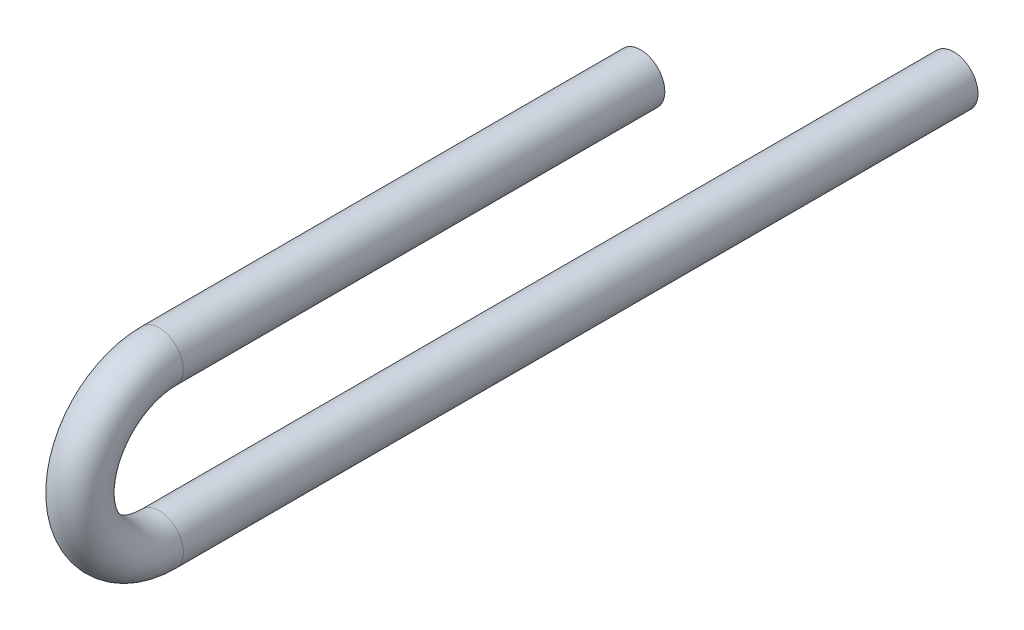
from build123d import *

# Parameters (mm, degrees)
SKETCH1_R          = 0.762
BASE_EXTRUDE_DEPTH = 12.7
SKETCH2_R          = 0.762


with BuildPart() as part:
    # Sketch1 → Base-Extrude (new body)
    with BuildSketch(Plane.XY):
        with Locations(Location((0, 0, 0), (0, 0, 90))):
            Circle(SKETCH1_R)
    extrude(amount=BASE_EXTRUDE_DEPTH)

    # Boss-Sweep1: sweep along a path in Sketch3
    with BuildLine(Plane(origin=(0, 0, 0), x_dir=(0, 0, -1), z_dir=(1, 0, 0))) as boss_sweep1_path:
        Line((-12.7, 0), (-15.187061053, 0))
        ThreePointArc((-15.187061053, 0), (-17.684549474, -2.497488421), (-15.187061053, -4.994976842))
        Line((-15.187061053, -4.994976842), (9.878193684, -4.994976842))
    # Sketch2 → Boss-Sweep1 (sweep)
    with BuildSketch(Plane.XY.offset(12.7)):
        Circle(SKETCH2_R)
    sweep(path=boss_sweep1_path.line)


solid = part.part
